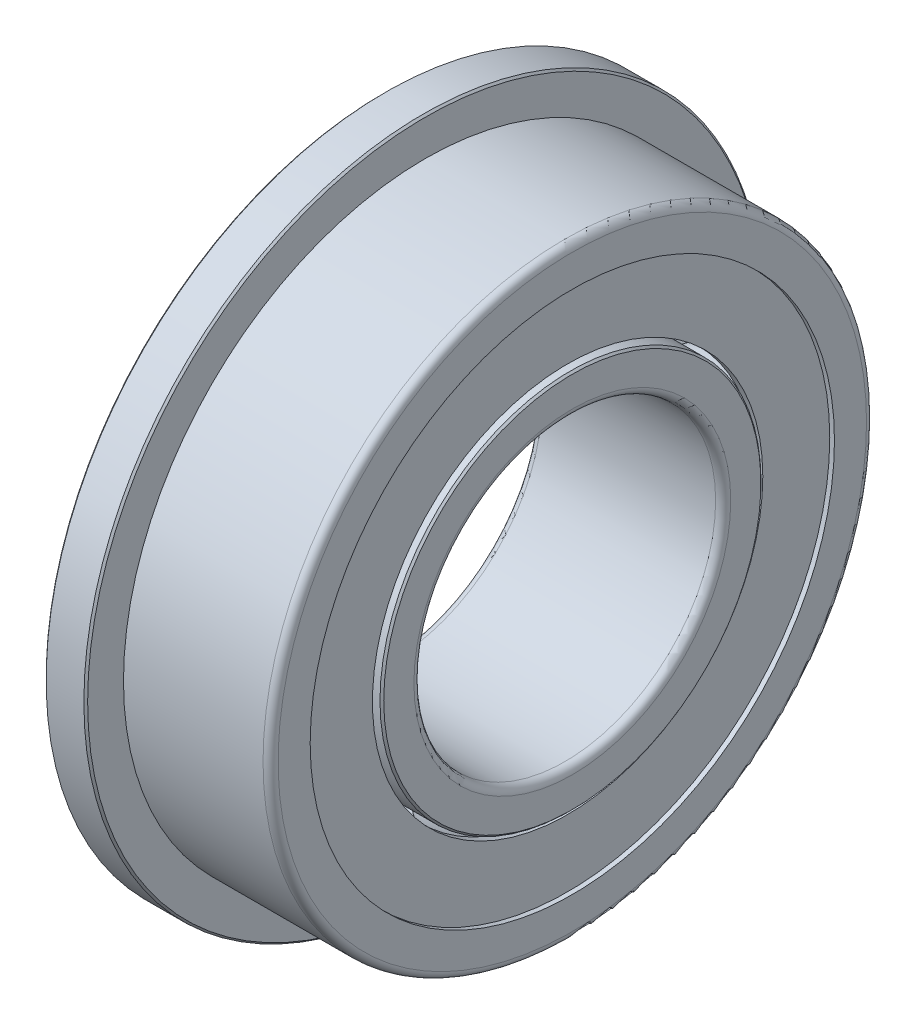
ISO-10303-21;
HEADER;
FILE_DESCRIPTION(('STEP AP214'),'2;1');
FILE_NAME('part.step','',(''),(''),'','','');
FILE_SCHEMA(('AUTOMOTIVE_DESIGN { 1 0 10303 214 1 1 1 1 }'));
ENDSEC;
DATA;
#1=APPLICATION_CONTEXT('core data for automotive mechanical design processes');
#2=APPLICATION_PROTOCOL_DEFINITION('international standard','automotive_design',2000,#1);
#3=PRODUCT_CONTEXT('',#1,'mechanical');
#4=PRODUCT('Part','Part','',(#3));
#5=PRODUCT_RELATED_PRODUCT_CATEGORY('part','',(#4));
#6=PRODUCT_DEFINITION_FORMATION('','',#4);
#7=PRODUCT_DEFINITION_CONTEXT('part definition',#1,'design');
#8=PRODUCT_DEFINITION('design','',#6,#7);
#9=PRODUCT_DEFINITION_SHAPE('','',#8);
#10=(LENGTH_UNIT() NAMED_UNIT(*) SI_UNIT(.MILLI.,.METRE.));
#11=(NAMED_UNIT(*) PLANE_ANGLE_UNIT() SI_UNIT($,.RADIAN.));
#12=(NAMED_UNIT(*) SI_UNIT($,.STERADIAN.) SOLID_ANGLE_UNIT());
#13=UNCERTAINTY_MEASURE_WITH_UNIT(LENGTH_MEASURE(1.E-05),#10,'distance_accuracy_value','');
#14=(GEOMETRIC_REPRESENTATION_CONTEXT(3) GLOBAL_UNCERTAINTY_ASSIGNED_CONTEXT((#13)) GLOBAL_UNIT_ASSIGNED_CONTEXT((#10,
#11,#12)) REPRESENTATION_CONTEXT('',''));
#15=CARTESIAN_POINT('',(0.,0.,0.));
#16=DIRECTION('',(0.,0.,1.));
#17=DIRECTION('',(1.,0.,0.));
#18=AXIS2_PLACEMENT_3D('',#15,#16,#17);
#19=CARTESIAN_POINT('',(0.,-4.24264068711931,4.24264068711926));
#20=DIRECTION('',(0.859568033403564,-0.507056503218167,-0.0635334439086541));
#21=DIRECTION('',(0.0508593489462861,-0.0388244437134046,0.997950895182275));
#22=AXIS2_PLACEMENT_3D('',#19,#20,#21);
#23=SPHERICAL_SURFACE('',#22,1.25);
#24=CARTESIAN_POINT('',(1.07446004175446,-4.87646131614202,4.16322388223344));
#25=VERTEX_POINT('',#24);
#26=VERTEX_LOOP('',#25);
#27=FACE_BOUND('',#26,.T.);
#28=CARTESIAN_POINT('',(-1.07446004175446,-3.6088200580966,4.32205749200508));
#29=VERTEX_POINT('',#28);
#30=VERTEX_LOOP('',#29);
#31=FACE_BOUND('',#30,.T.);
#32=ADVANCED_FACE('P0_F16',(#27,#31),#23,.T.);
#33=CLOSED_SHELL('',(#32));
#34=MANIFOLD_SOLID_BREP('P0_B1',#33);
#35=CARTESIAN_POINT('',(2.375,6.95,0.));
#36=DIRECTION('',(-1.,0.,0.));
#37=DIRECTION('',(0.,0.,1.));
#38=AXIS2_PLACEMENT_3D('',#35,#36,#37);
#39=PLANE('',#38);
#40=CARTESIAN_POINT('',(2.375,0.,0.));
#41=DIRECTION('',(1.,0.,0.));
#42=DIRECTION('',(0.,0.,-1.));
#43=AXIS2_PLACEMENT_3D('',#40,#41,#42);
#44=CIRCLE('',#43,5.175);
#45=CARTESIAN_POINT('',(2.375,0.,-5.175));
#46=VERTEX_POINT('',#45);
#47=EDGE_CURVE('P1_E18',#46,#46,#44,.F.);
#48=ORIENTED_EDGE('',*,*,#47,.T.);
#49=EDGE_LOOP('',(#48));
#50=FACE_BOUND('',#49,.T.);
#51=CARTESIAN_POINT('',(2.375,0.,0.));
#52=DIRECTION('',(1.,0.,0.));
#53=DIRECTION('',(0.,0.,-1.));
#54=AXIS2_PLACEMENT_3D('',#51,#52,#53);
#55=CIRCLE('',#54,6.95);
#56=CARTESIAN_POINT('',(2.375,0.,-6.95));
#57=VERTEX_POINT('',#56);
#58=EDGE_CURVE('P1_E64',#57,#57,#55,.T.);
#59=ORIENTED_EDGE('',*,*,#58,.T.);
#60=EDGE_LOOP('',(#59));
#61=FACE_BOUND('',#60,.T.);
#62=ADVANCED_FACE('P1_F15',(#50,#61),#39,.F.);
#63=CARTESIAN_POINT('',(-1.06453611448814,0.,0.));
#64=DIRECTION('',(1.,0.,0.));
#65=DIRECTION('',(0.,0.,-1.));
#66=AXIS2_PLACEMENT_3D('',#63,#64,#65);
#67=CYLINDRICAL_SURFACE('',#66,5.175);
#68=CARTESIAN_POINT('',(2.1875,0.,0.));
#69=DIRECTION('',(1.,0.,0.));
#70=DIRECTION('',(0.,0.,-1.));
#71=AXIS2_PLACEMENT_3D('',#68,#69,#70);
#72=CIRCLE('',#71,5.175);
#73=CARTESIAN_POINT('',(2.1875,0.,-5.175));
#74=VERTEX_POINT('',#73);
#75=EDGE_CURVE('P1_E62',#74,#74,#72,.F.);
#76=ORIENTED_EDGE('',*,*,#75,.T.);
#77=EDGE_LOOP('',(#76));
#78=FACE_BOUND('',#77,.T.);
#79=ORIENTED_EDGE('',*,*,#47,.F.);
#80=EDGE_LOOP('',(#79));
#81=FACE_BOUND('',#80,.T.);
#82=ADVANCED_FACE('P1_F72',(#78,#81),#67,.F.);
#83=CARTESIAN_POINT('',(-2.5,0.,0.));
#84=DIRECTION('',(1.,0.,0.));
#85=DIRECTION('',(0.,0.,-1.));
#86=AXIS2_PLACEMENT_3D('',#83,#84,#85);
#87=CYLINDRICAL_SURFACE('',#86,6.95);
#88=ORIENTED_EDGE('',*,*,#58,.F.);
#89=EDGE_LOOP('',(#88));
#90=FACE_BOUND('',#89,.T.);
#91=CARTESIAN_POINT('',(2.5,0.,0.));
#92=DIRECTION('',(1.,0.,0.));
#93=DIRECTION('',(0.,0.,-1.));
#94=AXIS2_PLACEMENT_3D('',#91,#92,#93);
#95=CIRCLE('',#94,6.95);
#96=CARTESIAN_POINT('',(2.5,0.,-6.95));
#97=VERTEX_POINT('',#96);
#98=EDGE_CURVE('P1_E59',#97,#97,#95,.T.);
#99=ORIENTED_EDGE('',*,*,#98,.T.);
#100=EDGE_LOOP('',(#99));
#101=FACE_BOUND('',#100,.T.);
#102=ADVANCED_FACE('P1_F74',(#90,#101),#87,.F.);
#103=CARTESIAN_POINT('',(2.1875,6.95,0.));
#104=DIRECTION('',(1.,0.,0.));
#105=DIRECTION('',(0.,0.,-1.));
#106=AXIS2_PLACEMENT_3D('',#103,#104,#105);
#107=PLANE('',#106);
#108=ORIENTED_EDGE('',*,*,#75,.F.);
#109=EDGE_LOOP('',(#108));
#110=FACE_BOUND('',#109,.T.);
#111=CARTESIAN_POINT('',(2.1875,0.,0.));
#112=DIRECTION('',(1.,0.,0.));
#113=DIRECTION('',(0.,0.,-1.));
#114=AXIS2_PLACEMENT_3D('',#111,#112,#113);
#115=CIRCLE('',#114,6.95);
#116=CARTESIAN_POINT('',(2.1875,0.,-6.95));
#117=VERTEX_POINT('',#116);
#118=EDGE_CURVE('P1_E55',#117,#117,#115,.F.);
#119=ORIENTED_EDGE('',*,*,#118,.T.);
#120=EDGE_LOOP('',(#119));
#121=FACE_BOUND('',#120,.T.);
#122=ADVANCED_FACE('P1_F82',(#110,#121),#107,.F.);
#123=CARTESIAN_POINT('',(2.5,6.95,0.));
#124=DIRECTION('',(-1.,0.,0.));
#125=DIRECTION('',(0.,0.,1.));
#126=AXIS2_PLACEMENT_3D('',#123,#124,#125);
#127=PLANE('',#126);
#128=ORIENTED_EDGE('',*,*,#98,.F.);
#129=EDGE_LOOP('',(#128));
#130=FACE_BOUND('',#129,.T.);
#131=CARTESIAN_POINT('',(2.5,0.,0.));
#132=DIRECTION('',(-1.,0.,0.));
#133=DIRECTION('',(0.,0.,-1.));
#134=AXIS2_PLACEMENT_3D('',#131,#132,#133);
#135=CIRCLE('',#134,7.8);
#136=CARTESIAN_POINT('',(2.5,0.,-7.8));
#137=VERTEX_POINT('',#136);
#138=EDGE_CURVE('P1_E58',#137,#137,#135,.T.);
#139=ORIENTED_EDGE('',*,*,#138,.F.);
#140=EDGE_LOOP('',(#139));
#141=FACE_BOUND('',#140,.T.);
#142=ADVANCED_FACE('P1_F159',(#130,#141),#127,.F.);
#143=CARTESIAN_POINT('',(-2.5,0.,0.));
#144=DIRECTION('',(1.,0.,0.));
#145=DIRECTION('',(0.,0.,-1.));
#146=AXIS2_PLACEMENT_3D('',#143,#144,#145);
#147=CYLINDRICAL_SURFACE('',#146,6.95);
#148=CARTESIAN_POINT('',(0.812403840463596,0.,0.));
#149=DIRECTION('',(-1.,0.,0.));
#150=DIRECTION('',(0.,0.,1.));
#151=AXIS2_PLACEMENT_3D('',#148,#149,#150);
#152=CIRCLE('',#151,6.95);
#153=CARTESIAN_POINT('',(0.812403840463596,0.,6.95));
#154=VERTEX_POINT('',#153);
#155=EDGE_CURVE('P1_E145',#154,#154,#152,.T.);
#156=ORIENTED_EDGE('',*,*,#155,.T.);
#157=EDGE_LOOP('',(#156));
#158=FACE_BOUND('',#157,.T.);
#159=ORIENTED_EDGE('',*,*,#118,.F.);
#160=EDGE_LOOP('',(#159));
#161=FACE_BOUND('',#160,.T.);
#162=ADVANCED_FACE('P1_F168',(#158,#161),#147,.F.);
#163=CARTESIAN_POINT('',(2.3,0.,0.));
#164=DIRECTION('',(-1.,0.,0.));
#165=DIRECTION('',(0.,0.,1.));
#166=AXIS2_PLACEMENT_3D('',#163,#164,#165);
#167=TOROIDAL_SURFACE('',#166,7.8,0.2);
#168=CARTESIAN_POINT('',(2.3,0.,0.));
#169=DIRECTION('',(1.,0.,0.));
#170=DIRECTION('',(0.,0.,-1.));
#171=AXIS2_PLACEMENT_3D('',#168,#169,#170);
#172=CIRCLE('',#171,8.);
#173=CARTESIAN_POINT('',(2.3,0.,-8.));
#174=VERTEX_POINT('',#173);
#175=EDGE_CURVE('P1_E148',#174,#174,#172,.F.);
#176=ORIENTED_EDGE('',*,*,#175,.F.);
#177=EDGE_LOOP('',(#176));
#178=FACE_BOUND('',#177,.T.);
#179=ORIENTED_EDGE('',*,*,#138,.T.);
#180=EDGE_LOOP('',(#179));
#181=FACE_BOUND('',#180,.T.);
#182=ADVANCED_FACE('P1_F136',(#178,#181),#167,.T.);
#183=CARTESIAN_POINT('',(0.,0.,0.));
#184=DIRECTION('',(-1.,0.,0.));
#185=DIRECTION('',(0.,0.,1.));
#186=AXIS2_PLACEMENT_3D('',#183,#184,#185);
#187=TOROIDAL_SURFACE('',#186,6.,1.25);
#188=CARTESIAN_POINT('',(-0.812403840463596,0.,0.));
#189=DIRECTION('',(1.,0.,0.));
#190=DIRECTION('',(0.,0.,-1.));
#191=AXIS2_PLACEMENT_3D('',#188,#189,#190);
#192=CIRCLE('',#191,6.95);
#193=CARTESIAN_POINT('',(-0.812403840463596,0.,-6.95));
#194=VERTEX_POINT('',#193);
#195=EDGE_CURVE('P1_E54',#194,#194,#192,.F.);
#196=ORIENTED_EDGE('',*,*,#195,.T.);
#197=EDGE_LOOP('',(#196));
#198=FACE_BOUND('',#197,.T.);
#199=ORIENTED_EDGE('',*,*,#155,.F.);
#200=EDGE_LOOP('',(#199));
#201=FACE_BOUND('',#200,.T.);
#202=ADVANCED_FACE('P1_F132',(#198,#201),#187,.F.);
#203=CARTESIAN_POINT('',(-2.5,0.,0.));
#204=DIRECTION('',(1.,0.,0.));
#205=DIRECTION('',(0.,0.,-1.));
#206=AXIS2_PLACEMENT_3D('',#203,#204,#205);
#207=CYLINDRICAL_SURFACE('',#206,8.);
#208=ORIENTED_EDGE('',*,*,#175,.T.);
#209=EDGE_LOOP('',(#208));
#210=FACE_BOUND('',#209,.T.);
#211=CARTESIAN_POINT('',(-1.4,0.,0.));
#212=DIRECTION('',(1.,0.,0.));
#213=DIRECTION('',(0.,0.,-1.));
#214=AXIS2_PLACEMENT_3D('',#211,#212,#213);
#215=CIRCLE('',#214,8.);
#216=CARTESIAN_POINT('',(-1.4,0.,-8.));
#217=VERTEX_POINT('',#216);
#218=EDGE_CURVE('P1_E51',#217,#217,#215,.T.);
#219=ORIENTED_EDGE('',*,*,#218,.T.);
#220=EDGE_LOOP('',(#219));
#221=FACE_BOUND('',#220,.T.);
#222=ADVANCED_FACE('P1_F128',(#210,#221),#207,.T.);
#223=CARTESIAN_POINT('',(-2.5,0.,0.));
#224=DIRECTION('',(1.,0.,0.));
#225=DIRECTION('',(0.,0.,-1.));
#226=AXIS2_PLACEMENT_3D('',#223,#224,#225);
#227=CYLINDRICAL_SURFACE('',#226,6.95);
#228=ORIENTED_EDGE('',*,*,#195,.F.);
#229=EDGE_LOOP('',(#228));
#230=FACE_BOUND('',#229,.T.);
#231=CARTESIAN_POINT('',(-2.1875,0.,0.));
#232=DIRECTION('',(1.,0.,0.));
#233=DIRECTION('',(0.,0.,-1.));
#234=AXIS2_PLACEMENT_3D('',#231,#232,#233);
#235=CIRCLE('',#234,6.95);
#236=CARTESIAN_POINT('',(-2.1875,0.,-6.95));
#237=VERTEX_POINT('',#236);
#238=EDGE_CURVE('P1_E48',#237,#237,#235,.F.);
#239=ORIENTED_EDGE('',*,*,#238,.T.);
#240=EDGE_LOOP('',(#239));
#241=FACE_BOUND('',#240,.T.);
#242=ADVANCED_FACE('P1_F124',(#230,#241),#227,.F.);
#243=CARTESIAN_POINT('',(-1.4,8.95,0.));
#244=DIRECTION('',(-1.,0.,0.));
#245=DIRECTION('',(0.,0.,1.));
#246=AXIS2_PLACEMENT_3D('',#243,#244,#245);
#247=PLANE('',#246);
#248=ORIENTED_EDGE('',*,*,#218,.F.);
#249=EDGE_LOOP('',(#248));
#250=FACE_BOUND('',#249,.T.);
#251=CARTESIAN_POINT('',(-1.4,0.,0.));
#252=DIRECTION('',(-1.,0.,0.));
#253=DIRECTION('',(0.,0.,1.));
#254=AXIS2_PLACEMENT_3D('',#251,#252,#253);
#255=CIRCLE('',#254,8.95);
#256=CARTESIAN_POINT('',(-1.4,0.,8.95));
#257=VERTEX_POINT('',#256);
#258=EDGE_CURVE('P1_E45',#257,#257,#255,.T.);
#259=ORIENTED_EDGE('',*,*,#258,.F.);
#260=EDGE_LOOP('',(#259));
#261=FACE_BOUND('',#260,.T.);
#262=ADVANCED_FACE('P1_F120',(#250,#261),#247,.F.);
#263=CARTESIAN_POINT('',(-2.1875,6.95,0.));
#264=DIRECTION('',(-1.,0.,0.));
#265=DIRECTION('',(0.,0.,1.));
#266=AXIS2_PLACEMENT_3D('',#263,#264,#265);
#267=PLANE('',#266);
#268=CARTESIAN_POINT('',(-2.1875,0.,0.));
#269=DIRECTION('',(1.,0.,0.));
#270=DIRECTION('',(0.,0.,-1.));
#271=AXIS2_PLACEMENT_3D('',#268,#269,#270);
#272=CIRCLE('',#271,5.175);
#273=CARTESIAN_POINT('',(-2.1875,0.,-5.175));
#274=VERTEX_POINT('',#273);
#275=EDGE_CURVE('P1_E42',#274,#274,#272,.F.);
#276=ORIENTED_EDGE('',*,*,#275,.T.);
#277=EDGE_LOOP('',(#276));
#278=FACE_BOUND('',#277,.T.);
#279=ORIENTED_EDGE('',*,*,#238,.F.);
#280=EDGE_LOOP('',(#279));
#281=FACE_BOUND('',#280,.T.);
#282=ADVANCED_FACE('P1_F116',(#278,#281),#267,.F.);
#283=CARTESIAN_POINT('',(-1.45,0.,0.));
#284=DIRECTION('',(-1.,0.,0.));
#285=DIRECTION('',(0.,0.,1.));
#286=AXIS2_PLACEMENT_3D('',#283,#284,#285);
#287=CONICAL_SURFACE('',#286,9.,0.785398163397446);
#288=CARTESIAN_POINT('',(-1.45,0.,0.));
#289=DIRECTION('',(1.,0.,0.));
#290=DIRECTION('',(0.,0.,-1.));
#291=AXIS2_PLACEMENT_3D('',#288,#289,#290);
#292=CIRCLE('',#291,9.);
#293=CARTESIAN_POINT('',(-1.45,0.,-9.));
#294=VERTEX_POINT('',#293);
#295=EDGE_CURVE('P1_E41',#294,#294,#292,.F.);
#296=ORIENTED_EDGE('',*,*,#295,.F.);
#297=EDGE_LOOP('',(#296));
#298=FACE_BOUND('',#297,.T.);
#299=ORIENTED_EDGE('',*,*,#258,.T.);
#300=EDGE_LOOP('',(#299));
#301=FACE_BOUND('',#300,.T.);
#302=ADVANCED_FACE('P1_F112',(#298,#301),#287,.T.);
#303=CARTESIAN_POINT('',(-1.06453611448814,0.,0.));
#304=DIRECTION('',(1.,0.,0.));
#305=DIRECTION('',(0.,0.,-1.));
#306=AXIS2_PLACEMENT_3D('',#303,#304,#305);
#307=CYLINDRICAL_SURFACE('',#306,5.175);
#308=CARTESIAN_POINT('',(-2.375,0.,0.));
#309=DIRECTION('',(1.,0.,0.));
#310=DIRECTION('',(0.,0.,-1.));
#311=AXIS2_PLACEMENT_3D('',#308,#309,#310);
#312=CIRCLE('',#311,5.175);
#313=CARTESIAN_POINT('',(-2.375,0.,-5.175));
#314=VERTEX_POINT('',#313);
#315=EDGE_CURVE('P1_E38',#314,#314,#312,.F.);
#316=ORIENTED_EDGE('',*,*,#315,.T.);
#317=EDGE_LOOP('',(#316));
#318=FACE_BOUND('',#317,.T.);
#319=ORIENTED_EDGE('',*,*,#275,.F.);
#320=EDGE_LOOP('',(#319));
#321=FACE_BOUND('',#320,.T.);
#322=ADVANCED_FACE('P1_F108',(#318,#321),#307,.F.);
#323=CARTESIAN_POINT('',(-3.78660254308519,0.,0.));
#324=DIRECTION('',(1.,0.,0.));
#325=DIRECTION('',(0.,0.,-1.));
#326=AXIS2_PLACEMENT_3D('',#323,#324,#325);
#327=CYLINDRICAL_SURFACE('',#326,9.);
#328=CARTESIAN_POINT('',(-2.45,0.,0.));
#329=DIRECTION('',(1.,0.,0.));
#330=DIRECTION('',(0.,0.,-1.));
#331=AXIS2_PLACEMENT_3D('',#328,#329,#330);
#332=CIRCLE('',#331,9.);
#333=CARTESIAN_POINT('',(-2.45,0.,-9.));
#334=VERTEX_POINT('',#333);
#335=EDGE_CURVE('P1_E37',#334,#334,#332,.F.);
#336=ORIENTED_EDGE('',*,*,#335,.F.);
#337=EDGE_LOOP('',(#336));
#338=FACE_BOUND('',#337,.T.);
#339=ORIENTED_EDGE('',*,*,#295,.T.);
#340=EDGE_LOOP('',(#339));
#341=FACE_BOUND('',#340,.T.);
#342=ADVANCED_FACE('P1_F104',(#338,#341),#327,.T.);
#343=CARTESIAN_POINT('',(-2.375,6.95,0.));
#344=DIRECTION('',(1.,0.,0.));
#345=DIRECTION('',(0.,0.,-1.));
#346=AXIS2_PLACEMENT_3D('',#343,#344,#345);
#347=PLANE('',#346);
#348=ORIENTED_EDGE('',*,*,#315,.F.);
#349=EDGE_LOOP('',(#348));
#350=FACE_BOUND('',#349,.T.);
#351=CARTESIAN_POINT('',(-2.375,0.,0.));
#352=DIRECTION('',(1.,0.,0.));
#353=DIRECTION('',(0.,0.,-1.));
#354=AXIS2_PLACEMENT_3D('',#351,#352,#353);
#355=CIRCLE('',#354,6.95);
#356=CARTESIAN_POINT('',(-2.375,0.,-6.95));
#357=VERTEX_POINT('',#356);
#358=EDGE_CURVE('P1_E27',#357,#357,#355,.F.);
#359=ORIENTED_EDGE('',*,*,#358,.T.);
#360=EDGE_LOOP('',(#359));
#361=FACE_BOUND('',#360,.T.);
#362=ADVANCED_FACE('P1_F100',(#350,#361),#347,.F.);
#363=CARTESIAN_POINT('',(-2.45,0.,0.));
#364=DIRECTION('',(1.,0.,0.));
#365=DIRECTION('',(0.,0.,-1.));
#366=AXIS2_PLACEMENT_3D('',#363,#364,#365);
#367=CONICAL_SURFACE('',#366,9.,0.785398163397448);
#368=ORIENTED_EDGE('',*,*,#335,.T.);
#369=EDGE_LOOP('',(#368));
#370=FACE_BOUND('',#369,.T.);
#371=CARTESIAN_POINT('',(-2.5,0.,0.));
#372=DIRECTION('',(1.,0.,0.));
#373=DIRECTION('',(0.,0.,-1.));
#374=AXIS2_PLACEMENT_3D('',#371,#372,#373);
#375=CIRCLE('',#374,8.95);
#376=CARTESIAN_POINT('',(-2.5,0.,-8.95));
#377=VERTEX_POINT('',#376);
#378=EDGE_CURVE('P1_E22',#377,#377,#375,.T.);
#379=ORIENTED_EDGE('',*,*,#378,.T.);
#380=EDGE_LOOP('',(#379));
#381=FACE_BOUND('',#380,.T.);
#382=ADVANCED_FACE('P1_F94',(#370,#381),#367,.T.);
#383=CARTESIAN_POINT('',(-2.5,0.,0.));
#384=DIRECTION('',(1.,0.,0.));
#385=DIRECTION('',(0.,0.,-1.));
#386=AXIS2_PLACEMENT_3D('',#383,#384,#385);
#387=CYLINDRICAL_SURFACE('',#386,6.95);
#388=CARTESIAN_POINT('',(-2.5,0.,0.));
#389=DIRECTION('',(1.,0.,0.));
#390=DIRECTION('',(0.,0.,-1.));
#391=AXIS2_PLACEMENT_3D('',#388,#389,#390);
#392=CIRCLE('',#391,6.95);
#393=CARTESIAN_POINT('',(-2.5,0.,-6.95));
#394=VERTEX_POINT('',#393);
#395=EDGE_CURVE('P1_E10',#394,#394,#392,.F.);
#396=ORIENTED_EDGE('',*,*,#395,.T.);
#397=EDGE_LOOP('',(#396));
#398=FACE_BOUND('',#397,.T.);
#399=ORIENTED_EDGE('',*,*,#358,.F.);
#400=EDGE_LOOP('',(#399));
#401=FACE_BOUND('',#400,.T.);
#402=ADVANCED_FACE('P1_F87',(#398,#401),#387,.F.);
#403=CARTESIAN_POINT('',(-2.5,6.95,0.));
#404=DIRECTION('',(1.,0.,0.));
#405=DIRECTION('',(0.,0.,-1.));
#406=AXIS2_PLACEMENT_3D('',#403,#404,#405);
#407=PLANE('',#406);
#408=ORIENTED_EDGE('',*,*,#395,.F.);
#409=EDGE_LOOP('',(#408));
#410=FACE_BOUND('',#409,.T.);
#411=ORIENTED_EDGE('',*,*,#378,.F.);
#412=EDGE_LOOP('',(#411));
#413=FACE_BOUND('',#412,.T.);
#414=ADVANCED_FACE('P1_F85',(#410,#413),#407,.F.);
#415=CLOSED_SHELL('',(#62,#82,#102,#122,#142,#162,#182,#202,#222,#242,#262,#282,#302,#322,#342,
#362,#382,#402,#414));
#416=MANIFOLD_SOLID_BREP('P1_B1',#415);
#417=CARTESIAN_POINT('',(0.,0.,0.));
#418=DIRECTION('',(-1.,0.,0.));
#419=DIRECTION('',(0.,0.,1.));
#420=AXIS2_PLACEMENT_3D('',#417,#418,#419);
#421=TOROIDAL_SURFACE('',#420,6.,1.25);
#422=CARTESIAN_POINT('',(0.812403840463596,0.,0.));
#423=DIRECTION('',(1.,0.,0.));
#424=DIRECTION('',(0.,0.,-1.));
#425=AXIS2_PLACEMENT_3D('',#422,#423,#424);
#426=CIRCLE('',#425,5.05);
#427=CARTESIAN_POINT('',(0.812403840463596,0.,-5.05));
#428=VERTEX_POINT('',#427);
#429=EDGE_CURVE('P2_E122',#428,#428,#426,.T.);
#430=ORIENTED_EDGE('',*,*,#429,.F.);
#431=EDGE_LOOP('',(#430));
#432=FACE_BOUND('',#431,.T.);
#433=CARTESIAN_POINT('',(-0.812403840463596,0.,0.));
#434=DIRECTION('',(1.,0.,0.));
#435=DIRECTION('',(0.,0.,-1.));
#436=AXIS2_PLACEMENT_3D('',#433,#434,#435);
#437=CIRCLE('',#436,5.05);
#438=CARTESIAN_POINT('',(-0.812403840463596,0.,-5.05));
#439=VERTEX_POINT('',#438);
#440=EDGE_CURVE('P2_E124',#439,#439,#437,.F.);
#441=ORIENTED_EDGE('',*,*,#440,.F.);
#442=EDGE_LOOP('',(#441));
#443=FACE_BOUND('',#442,.T.);
#444=ADVANCED_FACE('P2_F15',(#432,#443),#421,.F.);
#445=CARTESIAN_POINT('',(-2.5,0.,0.));
#446=DIRECTION('',(1.,0.,0.));
#447=DIRECTION('',(0.,0.,-1.));
#448=AXIS2_PLACEMENT_3D('',#445,#446,#447);
#449=CYLINDRICAL_SURFACE('',#448,5.05);
#450=ORIENTED_EDGE('',*,*,#429,.T.);
#451=EDGE_LOOP('',(#450));
#452=FACE_BOUND('',#451,.T.);
#453=CARTESIAN_POINT('',(2.45000000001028,0.,0.));
#454=DIRECTION('',(-1.,0.,0.));
#455=DIRECTION('',(0.,0.,1.));
#456=AXIS2_PLACEMENT_3D('',#453,#454,#455);
#457=CIRCLE('',#456,5.04999999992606);
#458=CARTESIAN_POINT('',(2.45000000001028,0.,5.04999999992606));
#459=VERTEX_POINT('',#458);
#460=EDGE_CURVE('P2_E126',#459,#459,#457,.F.);
#461=ORIENTED_EDGE('',*,*,#460,.F.);
#462=EDGE_LOOP('',(#461));
#463=FACE_BOUND('',#462,.T.);
#464=ADVANCED_FACE('P2_F88',(#452,#463),#449,.T.);
#465=CARTESIAN_POINT('',(-2.5,0.,0.));
#466=DIRECTION('',(1.,0.,0.));
#467=DIRECTION('',(0.,0.,-1.));
#468=AXIS2_PLACEMENT_3D('',#465,#466,#467);
#469=CYLINDRICAL_SURFACE('',#468,5.05);
#470=CARTESIAN_POINT('',(-2.45000000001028,0.,0.));
#471=DIRECTION('',(1.,0.,0.));
#472=DIRECTION('',(0.,0.,-1.));
#473=AXIS2_PLACEMENT_3D('',#470,#471,#472);
#474=CIRCLE('',#473,5.0499999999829);
#475=CARTESIAN_POINT('',(-2.45000000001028,0.,-5.0499999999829));
#476=VERTEX_POINT('',#475);
#477=EDGE_CURVE('P2_E120',#476,#476,#474,.F.);
#478=ORIENTED_EDGE('',*,*,#477,.F.);
#479=EDGE_LOOP('',(#478));
#480=FACE_BOUND('',#479,.T.);
#481=ORIENTED_EDGE('',*,*,#440,.T.);
#482=EDGE_LOOP('',(#481));
#483=FACE_BOUND('',#482,.T.);
#484=ADVANCED_FACE('P2_F85',(#480,#483),#469,.T.);
#485=CARTESIAN_POINT('',(2.45000000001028,0.,0.));
#486=DIRECTION('',(-1.,0.,0.));
#487=DIRECTION('',(0.,0.,1.));
#488=AXIS2_PLACEMENT_3D('',#485,#486,#487);
#489=CONICAL_SURFACE('',#488,5.04999999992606,0.785398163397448);
#490=ORIENTED_EDGE('',*,*,#460,.T.);
#491=EDGE_LOOP('',(#490));
#492=FACE_BOUND('',#491,.T.);
#493=CARTESIAN_POINT('',(2.49999999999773,0.,0.));
#494=DIRECTION('',(-1.,0.,0.));
#495=DIRECTION('',(0.,0.,1.));
#496=AXIS2_PLACEMENT_3D('',#493,#494,#495);
#497=CIRCLE('',#496,4.99999999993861);
#498=CARTESIAN_POINT('',(2.49999999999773,0.,4.99999999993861));
#499=VERTEX_POINT('',#498);
#500=EDGE_CURVE('P2_E19',#499,#499,#497,.T.);
#501=ORIENTED_EDGE('',*,*,#500,.T.);
#502=EDGE_LOOP('',(#501));
#503=FACE_BOUND('',#502,.T.);
#504=ADVANCED_FACE('P2_F81',(#492,#503),#489,.T.);
#505=CARTESIAN_POINT('',(-2.45000000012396,0.,0.));
#506=DIRECTION('',(1.,0.,0.));
#507=DIRECTION('',(0.,0.,-1.));
#508=AXIS2_PLACEMENT_3D('',#505,#506,#507);
#509=CONICAL_SURFACE('',#508,5.04999999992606,0.785398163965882);
#510=ORIENTED_EDGE('',*,*,#477,.T.);
#511=EDGE_LOOP('',(#510));
#512=FACE_BOUND('',#511,.T.);
#513=CARTESIAN_POINT('',(-2.49999999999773,0.,0.));
#514=DIRECTION('',(1.,0.,0.));
#515=DIRECTION('',(0.,0.,-1.));
#516=AXIS2_PLACEMENT_3D('',#513,#514,#515);
#517=CIRCLE('',#516,4.99999999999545);
#518=CARTESIAN_POINT('',(-2.49999999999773,0.,-4.99999999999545));
#519=VERTEX_POINT('',#518);
#520=EDGE_CURVE('P2_E115',#519,#519,#517,.T.);
#521=ORIENTED_EDGE('',*,*,#520,.T.);
#522=EDGE_LOOP('',(#521));
#523=FACE_BOUND('',#522,.T.);
#524=ADVANCED_FACE('P2_F77',(#512,#523),#509,.T.);
#525=CARTESIAN_POINT('',(2.5,5.,0.));
#526=DIRECTION('',(-1.,0.,0.));
#527=DIRECTION('',(0.,0.,1.));
#528=AXIS2_PLACEMENT_3D('',#525,#526,#527);
#529=PLANE('',#528);
#530=CARTESIAN_POINT('',(2.5,0.,0.));
#531=DIRECTION('',(1.,0.,0.));
#532=DIRECTION('',(0.,0.,1.));
#533=AXIS2_PLACEMENT_3D('',#530,#531,#532);
#534=CIRCLE('',#533,4.2);
#535=CARTESIAN_POINT('',(2.5,0.,4.2));
#536=VERTEX_POINT('',#535);
#537=EDGE_CURVE('P2_E61',#536,#536,#534,.T.);
#538=ORIENTED_EDGE('',*,*,#537,.F.);
#539=EDGE_LOOP('',(#538));
#540=FACE_BOUND('',#539,.T.);
#541=ORIENTED_EDGE('',*,*,#500,.F.);
#542=EDGE_LOOP('',(#541));
#543=FACE_BOUND('',#542,.T.);
#544=ADVANCED_FACE('P2_F67',(#540,#543),#529,.F.);
#545=CARTESIAN_POINT('',(-2.5,4.2,0.));
#546=DIRECTION('',(1.,0.,0.));
#547=DIRECTION('',(0.,0.,-1.));
#548=AXIS2_PLACEMENT_3D('',#545,#546,#547);
#549=PLANE('',#548);
#550=CARTESIAN_POINT('',(-2.5,0.,0.));
#551=DIRECTION('',(-1.,0.,0.));
#552=DIRECTION('',(0.,0.,-1.));
#553=AXIS2_PLACEMENT_3D('',#550,#551,#552);
#554=CIRCLE('',#553,4.2);
#555=CARTESIAN_POINT('',(-2.5,0.,-4.2));
#556=VERTEX_POINT('',#555);
#557=EDGE_CURVE('P2_E28',#556,#556,#554,.T.);
#558=ORIENTED_EDGE('',*,*,#557,.F.);
#559=EDGE_LOOP('',(#558));
#560=FACE_BOUND('',#559,.T.);
#561=ORIENTED_EDGE('',*,*,#520,.F.);
#562=EDGE_LOOP('',(#561));
#563=FACE_BOUND('',#562,.T.);
#564=ADVANCED_FACE('P2_F76',(#560,#563),#549,.F.);
#565=CARTESIAN_POINT('',(2.3,0.,0.));
#566=DIRECTION('',(-1.,0.,0.));
#567=DIRECTION('',(0.,0.,1.));
#568=AXIS2_PLACEMENT_3D('',#565,#566,#567);
#569=TOROIDAL_SURFACE('',#568,4.2,0.2);
#570=ORIENTED_EDGE('',*,*,#537,.T.);
#571=EDGE_LOOP('',(#570));
#572=FACE_BOUND('',#571,.T.);
#573=CARTESIAN_POINT('',(2.3,0.,0.));
#574=DIRECTION('',(1.,0.,0.));
#575=DIRECTION('',(0.,0.,-1.));
#576=AXIS2_PLACEMENT_3D('',#573,#574,#575);
#577=CIRCLE('',#576,4.);
#578=CARTESIAN_POINT('',(2.3,0.,-4.));
#579=VERTEX_POINT('',#578);
#580=EDGE_CURVE('P2_E23',#579,#579,#577,.F.);
#581=ORIENTED_EDGE('',*,*,#580,.T.);
#582=EDGE_LOOP('',(#581));
#583=FACE_BOUND('',#582,.T.);
#584=ADVANCED_FACE('P2_F42',(#572,#583),#569,.T.);
#585=CARTESIAN_POINT('',(-2.3,0.,0.));
#586=DIRECTION('',(-1.,0.,0.));
#587=DIRECTION('',(0.,0.,1.));
#588=AXIS2_PLACEMENT_3D('',#585,#586,#587);
#589=TOROIDAL_SURFACE('',#588,4.2,0.2);
#590=CARTESIAN_POINT('',(-2.3,0.,0.));
#591=DIRECTION('',(1.,0.,0.));
#592=DIRECTION('',(0.,0.,-1.));
#593=AXIS2_PLACEMENT_3D('',#590,#591,#592);
#594=CIRCLE('',#593,4.);
#595=CARTESIAN_POINT('',(-2.3,0.,-4.));
#596=VERTEX_POINT('',#595);
#597=EDGE_CURVE('P2_E10',#596,#596,#594,.T.);
#598=ORIENTED_EDGE('',*,*,#597,.T.);
#599=EDGE_LOOP('',(#598));
#600=FACE_BOUND('',#599,.T.);
#601=ORIENTED_EDGE('',*,*,#557,.T.);
#602=EDGE_LOOP('',(#601));
#603=FACE_BOUND('',#602,.T.);
#604=ADVANCED_FACE('P2_F36',(#600,#603),#589,.T.);
#605=CARTESIAN_POINT('',(-2.5,0.,0.));
#606=DIRECTION('',(1.,0.,0.));
#607=DIRECTION('',(0.,0.,-1.));
#608=AXIS2_PLACEMENT_3D('',#605,#606,#607);
#609=CYLINDRICAL_SURFACE('',#608,4.);
#610=ORIENTED_EDGE('',*,*,#597,.F.);
#611=EDGE_LOOP('',(#610));
#612=FACE_BOUND('',#611,.T.);
#613=ORIENTED_EDGE('',*,*,#580,.F.);
#614=EDGE_LOOP('',(#613));
#615=FACE_BOUND('',#614,.T.);
#616=ADVANCED_FACE('P2_F41',(#612,#615),#609,.F.);
#617=CLOSED_SHELL('',(#444,#464,#484,#504,#524,#544,#564,#584,#604,#616));
#618=MANIFOLD_SOLID_BREP('P2_B1',#617);
#619=CARTESIAN_POINT('',(0.,6.,0.));
#620=DIRECTION('',(0.859568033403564,0.313618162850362,0.403468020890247));
#621=DIRECTION('',(0.0508593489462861,0.733110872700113,-0.678204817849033));
#622=AXIS2_PLACEMENT_3D('',#619,#620,#621);
#623=SPHERICAL_SURFACE('',#622,1.25);
#624=CARTESIAN_POINT('',(1.07446004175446,6.39202270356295,0.504335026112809));
#625=VERTEX_POINT('',#624);
#626=VERTEX_LOOP('',#625);
#627=FACE_BOUND('',#626,.T.);
#628=CARTESIAN_POINT('',(-1.07446004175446,5.60797729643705,-0.504335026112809));
#629=VERTEX_POINT('',#628);
#630=VERTEX_LOOP('',#629);
#631=FACE_BOUND('',#630,.T.);
#632=ADVANCED_FACE('P3_F16',(#627,#631),#623,.T.);
#633=CLOSED_SHELL('',(#632));
#634=MANIFOLD_SOLID_BREP('P3_B1',#633);
#635=CARTESIAN_POINT('',(0.,0.,-6.));
#636=DIRECTION('',(0.859568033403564,0.40346802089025,-0.313618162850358));
#637=DIRECTION('',(0.050859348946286,-0.678204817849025,-0.73311087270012));
#638=AXIS2_PLACEMENT_3D('',#635,#636,#637);
#639=SPHERICAL_SURFACE('',#638,1.25);
#640=CARTESIAN_POINT('',(1.07446004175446,0.504335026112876,-6.39202270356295));
#641=VERTEX_POINT('',#640);
#642=VERTEX_LOOP('',#641);
#643=FACE_BOUND('',#642,.T.);
#644=CARTESIAN_POINT('',(-1.07446004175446,-0.50433502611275,-5.60797729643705));
#645=VERTEX_POINT('',#644);
#646=VERTEX_LOOP('',#645);
#647=FACE_BOUND('',#646,.T.);
#648=ADVANCED_FACE('P4_F16',(#643,#647),#639,.T.);
#649=CLOSED_SHELL('',(#648));
#650=MANIFOLD_SOLID_BREP('P4_B1',#649);
#651=CARTESIAN_POINT('',(0.,4.24264068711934,-4.24264068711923));
#652=DIRECTION('',(0.859568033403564,0.507056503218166,0.0635334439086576));
#653=DIRECTION('',(0.0508593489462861,0.0388244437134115,-0.997950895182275));
#654=AXIS2_PLACEMENT_3D('',#651,#652,#653);
#655=SPHERICAL_SURFACE('',#654,1.25);
#656=CARTESIAN_POINT('',(1.07446004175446,4.87646131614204,-4.16322388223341));
#657=VERTEX_POINT('',#656);
#658=VERTEX_LOOP('',#657);
#659=FACE_BOUND('',#658,.T.);
#660=CARTESIAN_POINT('',(-1.07446004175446,3.60882005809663,-4.32205749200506));
#661=VERTEX_POINT('',#660);
#662=VERTEX_LOOP('',#661);
#663=FACE_BOUND('',#662,.T.);
#664=ADVANCED_FACE('P5_F15',(#659,#663),#655,.T.);
#665=CLOSED_SHELL('',(#664));
#666=MANIFOLD_SOLID_BREP('P5_B1',#665);
#667=CARTESIAN_POINT('',(0.,0.,6.));
#668=DIRECTION('',(0.859568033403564,-0.403468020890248,0.31361816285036));
#669=DIRECTION('',(0.0508593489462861,0.67820481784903,0.733110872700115));
#670=AXIS2_PLACEMENT_3D('',#667,#668,#669);
#671=SPHERICAL_SURFACE('',#670,1.25);
#672=CARTESIAN_POINT('',(1.07446004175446,-0.504335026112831,6.39202270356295));
#673=VERTEX_POINT('',#672);
#674=VERTEX_LOOP('',#673);
#675=FACE_BOUND('',#674,.T.);
#676=CARTESIAN_POINT('',(-1.07446004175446,0.504335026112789,5.60797729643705));
#677=VERTEX_POINT('',#676);
#678=VERTEX_LOOP('',#677);
#679=FACE_BOUND('',#678,.T.);
#680=ADVANCED_FACE('P6_F16',(#675,#679),#671,.T.);
#681=CLOSED_SHELL('',(#680));
#682=MANIFOLD_SOLID_BREP('P6_B1',#681);
#683=CARTESIAN_POINT('',(0.,4.24264068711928,4.24264068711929));
#684=DIRECTION('',(0.859568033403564,-0.0635334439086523,0.507056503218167));
#685=DIRECTION('',(0.0508593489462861,0.997950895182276,0.0388244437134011));
#686=AXIS2_PLACEMENT_3D('',#683,#684,#685);
#687=SPHERICAL_SURFACE('',#686,1.25);
#688=CARTESIAN_POINT('',(1.07446004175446,4.16322388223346,4.876461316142));
#689=VERTEX_POINT('',#688);
#690=VERTEX_LOOP('',#689);
#691=FACE_BOUND('',#690,.T.);
#692=CARTESIAN_POINT('',(-1.07446004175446,4.32205749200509,3.60882005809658));
#693=VERTEX_POINT('',#692);
#694=VERTEX_LOOP('',#693);
#695=FACE_BOUND('',#694,.T.);
#696=ADVANCED_FACE('P7_F16',(#691,#695),#687,.T.);
#697=CLOSED_SHELL('',(#696));
#698=MANIFOLD_SOLID_BREP('P7_B1',#697);
#699=CARTESIAN_POINT('',(0.,-4.24264068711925,-4.24264068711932));
#700=DIRECTION('',(0.859568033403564,0.0635334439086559,-0.507056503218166));
#701=DIRECTION('',(0.0508593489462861,-0.997950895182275,-0.038824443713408));
#702=AXIS2_PLACEMENT_3D('',#699,#700,#701);
#703=SPHERICAL_SURFACE('',#702,1.25);
#704=CARTESIAN_POINT('',(1.07446004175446,-4.16322388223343,-4.87646131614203));
#705=VERTEX_POINT('',#704);
#706=VERTEX_LOOP('',#705);
#707=FACE_BOUND('',#706,.T.);
#708=CARTESIAN_POINT('',(-1.07446004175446,-4.32205749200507,-3.60882005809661));
#709=VERTEX_POINT('',#708);
#710=VERTEX_LOOP('',#709);
#711=FACE_BOUND('',#710,.T.);
#712=ADVANCED_FACE('P8_F16',(#707,#711),#703,.T.);
#713=CLOSED_SHELL('',(#712));
#714=MANIFOLD_SOLID_BREP('P8_B1',#713);
#715=CARTESIAN_POINT('',(0.,-6.,0.));
#716=DIRECTION('',(0.859568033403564,-0.313618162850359,-0.403468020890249));
#717=DIRECTION('',(0.050859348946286,-0.733110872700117,0.678204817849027));
#718=AXIS2_PLACEMENT_3D('',#715,#716,#717);
#719=SPHERICAL_SURFACE('',#718,1.25);
#720=CARTESIAN_POINT('',(1.07446004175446,-6.39202270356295,-0.504335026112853));
#721=VERTEX_POINT('',#720);
#722=VERTEX_LOOP('',#721);
#723=FACE_BOUND('',#722,.T.);
#724=CARTESIAN_POINT('',(-1.07446004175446,-5.60797729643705,0.50433502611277));
#725=VERTEX_POINT('',#724);
#726=VERTEX_LOOP('',#725);
#727=FACE_BOUND('',#726,.T.);
#728=ADVANCED_FACE('P9_F16',(#723,#727),#719,.T.);
#729=CLOSED_SHELL('',(#728));
#730=MANIFOLD_SOLID_BREP('P9_B1',#729);
#731=ADVANCED_BREP_SHAPE_REPRESENTATION('',(#18,#34,#416,#618,#634,#650,#666,#682,#698,#714,
#730),#14);
#732=SHAPE_DEFINITION_REPRESENTATION(#9,#731);
ENDSEC;
END-ISO-10303-21;
